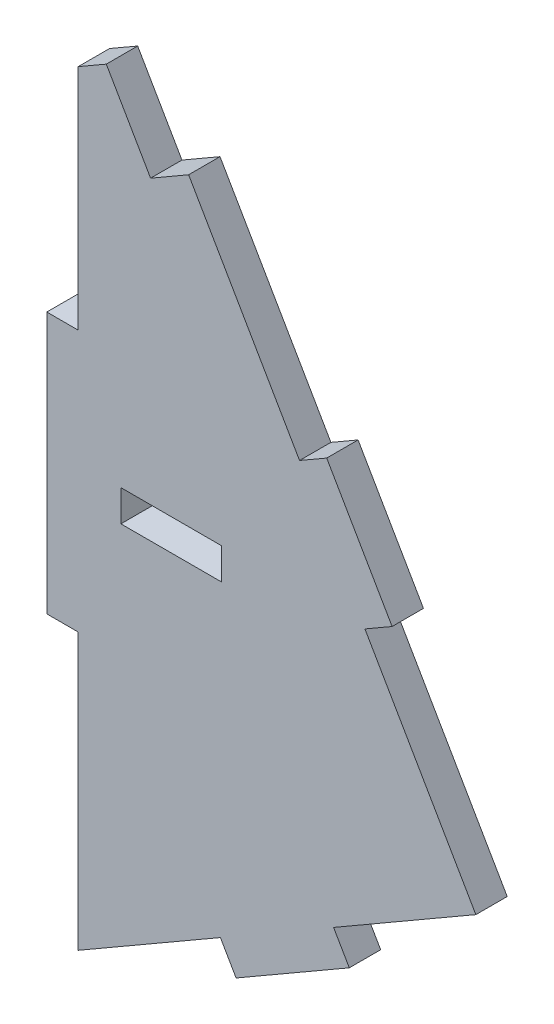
ISO-10303-21;
HEADER;
FILE_DESCRIPTION(('STEP AP214'),'2;1');
FILE_NAME('part.step','',(''),(''),'','','');
FILE_SCHEMA(('AUTOMOTIVE_DESIGN { 1 0 10303 214 1 1 1 1 }'));
ENDSEC;
DATA;
#1=APPLICATION_CONTEXT('core data for automotive mechanical design processes');
#2=APPLICATION_PROTOCOL_DEFINITION('international standard','automotive_design',2000,#1);
#3=PRODUCT_CONTEXT('',#1,'mechanical');
#4=PRODUCT('Part','Part','',(#3));
#5=PRODUCT_RELATED_PRODUCT_CATEGORY('part','',(#4));
#6=PRODUCT_DEFINITION_FORMATION('','',#4);
#7=PRODUCT_DEFINITION_CONTEXT('part definition',#1,'design');
#8=PRODUCT_DEFINITION('design','',#6,#7);
#9=PRODUCT_DEFINITION_SHAPE('','',#8);
#10=(LENGTH_UNIT() NAMED_UNIT(*) SI_UNIT(.MILLI.,.METRE.));
#11=(NAMED_UNIT(*) PLANE_ANGLE_UNIT() SI_UNIT($,.RADIAN.));
#12=(NAMED_UNIT(*) SI_UNIT($,.STERADIAN.) SOLID_ANGLE_UNIT());
#13=UNCERTAINTY_MEASURE_WITH_UNIT(LENGTH_MEASURE(1.E-05),#10,'distance_accuracy_value','');
#14=(GEOMETRIC_REPRESENTATION_CONTEXT(3) GLOBAL_UNCERTAINTY_ASSIGNED_CONTEXT((#13)) GLOBAL_UNIT_ASSIGNED_CONTEXT((#10,
#11,#12)) REPRESENTATION_CONTEXT('',''));
#15=CARTESIAN_POINT('',(0.,0.,0.));
#16=DIRECTION('',(0.,0.,1.));
#17=DIRECTION('',(1.,0.,0.));
#18=AXIS2_PLACEMENT_3D('',#15,#16,#17);
#19=CARTESIAN_POINT('',(0.,0.,1.524));
#20=DIRECTION('',(0.,0.,1.));
#21=DIRECTION('',(1.,0.,0.));
#22=AXIS2_PLACEMENT_3D('',#19,#20,#21);
#23=PLANE('',#22);
#24=DIRECTION('',(0.,-1.,0.));
#25=VECTOR('',#24,1.);
#26=CARTESIAN_POINT('',(1.524,-21.2606271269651,1.524));
#27=LINE('',#26,#25);
#28=CARTESIAN_POINT('',(1.524,-7.86895151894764,1.524));
#29=VERTEX_POINT('',#28);
#30=CARTESIAN_POINT('',(1.524,-21.2606271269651,1.524));
#31=VERTEX_POINT('',#30);
#32=EDGE_CURVE('E221',#29,#31,#27,.T.);
#33=ORIENTED_EDGE('',*,*,#32,.T.);
#34=DIRECTION('',(0.865892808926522,0.50022959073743,0.));
#35=VECTOR('',#34,1.);
#36=CARTESIAN_POINT('',(8.43381798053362,-17.268798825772,1.524));
#37=LINE('',#36,#35);
#38=CARTESIAN_POINT('',(8.43381798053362,-17.268798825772,1.524));
#39=VERTEX_POINT('',#38);
#40=EDGE_CURVE('E224',#31,#39,#37,.T.);
#41=ORIENTED_EDGE('',*,*,#40,.T.);
#42=DIRECTION('',(0.500229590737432,-0.865892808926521,0.));
#43=VECTOR('',#42,1.);
#44=CARTESIAN_POINT('',(8.43381798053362,-17.268798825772,1.524));
#45=LINE('',#44,#43);
#46=CARTESIAN_POINT('',(9.19616787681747,-18.588419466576,1.524));
#47=VERTEX_POINT('',#46);
#48=EDGE_CURVE('E227',#39,#47,#45,.T.);
#49=ORIENTED_EDGE('',*,*,#48,.T.);
#50=DIRECTION('',(0.865892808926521,0.500229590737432,0.));
#51=VECTOR('',#50,1.);
#52=CARTESIAN_POINT('',(9.19616787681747,-18.588419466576,1.524));
#53=LINE('',#52,#51);
#54=CARTESIAN_POINT('',(14.6945872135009,-15.4119615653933,1.524));
#55=VERTEX_POINT('',#54);
#56=EDGE_CURVE('E229',#47,#55,#53,.T.);
#57=ORIENTED_EDGE('',*,*,#56,.T.);
#58=DIRECTION('',(-0.500229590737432,0.865892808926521,0.));
#59=VECTOR('',#58,1.);
#60=CARTESIAN_POINT('',(13.932237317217,-14.0923409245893,1.524));
#61=LINE('',#60,#59);
#62=CARTESIAN_POINT('',(13.932237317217,-14.0923409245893,1.524));
#63=VERTEX_POINT('',#62);
#64=EDGE_CURVE('E231',#55,#63,#61,.T.);
#65=ORIENTED_EDGE('',*,*,#64,.T.);
#66=DIRECTION('',(0.865892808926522,0.500229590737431,0.));
#67=VECTOR('',#66,1.);
#68=CARTESIAN_POINT('',(20.8420552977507,-10.1005126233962,1.524));
#69=LINE('',#68,#67);
#70=CARTESIAN_POINT('',(20.8420552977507,-10.1005126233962,1.524));
#71=VERTEX_POINT('',#70);
#72=EDGE_CURVE('E233',#63,#71,#69,.T.);
#73=ORIENTED_EDGE('',*,*,#72,.T.);
#74=DIRECTION('',(-0.500229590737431,0.865892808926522,0.));
#75=VECTOR('',#74,1.);
#76=CARTESIAN_POINT('',(15.4543358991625,-0.774420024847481,1.524));
#77=LINE('',#76,#75);
#78=CARTESIAN_POINT('',(15.4543358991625,-0.774420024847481,1.524));
#79=VERTEX_POINT('',#78);
#80=EDGE_CURVE('E235',#71,#79,#77,.T.);
#81=ORIENTED_EDGE('',*,*,#80,.T.);
#82=DIRECTION('',(0.865892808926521,0.500229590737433,0.));
#83=VECTOR('',#82,1.);
#84=CARTESIAN_POINT('',(15.4543358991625,-0.774420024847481,1.524));
#85=LINE('',#84,#83);
#86=CARTESIAN_POINT('',(16.7739565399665,-0.0120701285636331,1.524));
#87=VERTEX_POINT('',#86);
#88=EDGE_CURVE('E237',#79,#87,#85,.T.);
#89=ORIENTED_EDGE('',*,*,#88,.T.);
#90=DIRECTION('',(-0.500229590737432,0.865892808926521,0.));
#91=VECTOR('',#90,1.);
#92=CARTESIAN_POINT('',(16.7739565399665,-0.0120701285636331,1.524));
#93=LINE('',#92,#91);
#94=CARTESIAN_POINT('',(13.5974986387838,5.48634920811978,1.524));
#95=VERTEX_POINT('',#94);
#96=EDGE_CURVE('E239',#87,#95,#93,.T.);
#97=ORIENTED_EDGE('',*,*,#96,.T.);
#98=DIRECTION('',(-0.865892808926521,-0.500229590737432,0.));
#99=VECTOR('',#98,1.);
#100=CARTESIAN_POINT('',(12.2778779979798,4.72399931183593,1.524));
#101=LINE('',#100,#99);
#102=CARTESIAN_POINT('',(12.2778779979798,4.72399931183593,1.524));
#103=VERTEX_POINT('',#102);
#104=EDGE_CURVE('E241',#95,#103,#101,.T.);
#105=ORIENTED_EDGE('',*,*,#104,.T.);
#106=DIRECTION('',(-0.500229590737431,0.865892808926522,0.));
#107=VECTOR('',#106,1.);
#108=CARTESIAN_POINT('',(6.89015859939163,14.0500919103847,1.524));
#109=LINE('',#108,#107);
#110=CARTESIAN_POINT('',(6.89015859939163,14.0500919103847,1.524));
#111=VERTEX_POINT('',#110);
#112=EDGE_CURVE('E243',#103,#111,#109,.T.);
#113=ORIENTED_EDGE('',*,*,#112,.T.);
#114=DIRECTION('',(-0.865892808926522,-0.500229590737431,0.));
#115=VECTOR('',#114,1.);
#116=CARTESIAN_POINT('',(5.04168218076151,12.9822200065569,1.524));
#117=LINE('',#116,#115);
#118=CARTESIAN_POINT('',(5.04168218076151,12.9822200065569,1.524));
#119=VERTEX_POINT('',#118);
#120=EDGE_CURVE('E245',#111,#119,#117,.T.);
#121=ORIENTED_EDGE('',*,*,#120,.T.);
#122=DIRECTION('',(-0.500229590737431,0.865892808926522,0.));
#123=VECTOR('',#122,1.);
#124=CARTESIAN_POINT('',(2.8908091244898,16.7053614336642,1.524));
#125=LINE('',#124,#123);
#126=CARTESIAN_POINT('',(2.8908091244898,16.7053614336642,1.524));
#127=VERTEX_POINT('',#126);
#128=EDGE_CURVE('E247',#119,#127,#125,.T.);
#129=ORIENTED_EDGE('',*,*,#128,.T.);
#130=DIRECTION('',(-0.865892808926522,-0.500229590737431,0.));
#131=VECTOR('',#130,1.);
#132=CARTESIAN_POINT('',(1.524,15.9157505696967,1.524));
#133=LINE('',#132,#131);
#134=CARTESIAN_POINT('',(1.524,15.9157505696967,1.524));
#135=VERTEX_POINT('',#134);
#136=EDGE_CURVE('E249',#127,#135,#133,.T.);
#137=ORIENTED_EDGE('',*,*,#136,.T.);
#138=DIRECTION('',(0.,-1.,0.));
#139=VECTOR('',#138,1.);
#140=CARTESIAN_POINT('',(1.524,4.83104848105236,1.524));
#141=LINE('',#140,#139);
#142=CARTESIAN_POINT('',(1.524,4.83104848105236,1.524));
#143=VERTEX_POINT('',#142);
#144=EDGE_CURVE('E251',#135,#143,#141,.T.);
#145=ORIENTED_EDGE('',*,*,#144,.T.);
#146=DIRECTION('',(-1.,0.,0.));
#147=VECTOR('',#146,1.);
#148=CARTESIAN_POINT('',(0.,4.83104848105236,1.524));
#149=LINE('',#148,#147);
#150=CARTESIAN_POINT('',(0.,4.83104848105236,1.524));
#151=VERTEX_POINT('',#150);
#152=EDGE_CURVE('E253',#143,#151,#149,.T.);
#153=ORIENTED_EDGE('',*,*,#152,.T.);
#154=DIRECTION('',(0.,-1.,0.));
#155=VECTOR('',#154,1.);
#156=CARTESIAN_POINT('',(0.,-7.86895151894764,1.524));
#157=LINE('',#156,#155);
#158=CARTESIAN_POINT('',(0.,-7.86895151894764,1.524));
#159=VERTEX_POINT('',#158);
#160=EDGE_CURVE('E255',#151,#159,#157,.T.);
#161=ORIENTED_EDGE('',*,*,#160,.T.);
#162=DIRECTION('',(1.,0.,0.));
#163=VECTOR('',#162,1.);
#164=CARTESIAN_POINT('',(1.524,-7.86895151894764,1.524));
#165=LINE('',#164,#163);
#166=EDGE_CURVE('E257',#159,#29,#165,.T.);
#167=ORIENTED_EDGE('',*,*,#166,.T.);
#168=EDGE_LOOP('',(#33,#41,#49,#57,#65,#73,#81,#89,#97,#105,#113,#121,#129,#137,#145,#153,#161,#167));
#169=FACE_BOUND('',#168,.T.);
#170=DIRECTION('',(1.,0.,0.));
#171=VECTOR('',#170,1.);
#172=CARTESIAN_POINT('',(3.59954891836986,-2.28095151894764,1.524));
#173=LINE('',#172,#171);
#174=CARTESIAN_POINT('',(3.59954891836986,-2.28095151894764,1.524));
#175=VERTEX_POINT('',#174);
#176=CARTESIAN_POINT('',(8.49527832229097,-2.28095151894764,1.524));
#177=VERTEX_POINT('',#176);
#178=EDGE_CURVE('E193',#175,#177,#173,.T.);
#179=ORIENTED_EDGE('',*,*,#178,.F.);
#180=DIRECTION('',(0.,-1.,0.));
#181=VECTOR('',#180,1.);
#182=CARTESIAN_POINT('',(3.59954891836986,-2.28095151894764,1.524));
#183=LINE('',#182,#181);
#184=CARTESIAN_POINT('',(3.59954891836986,-0.756951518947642,1.524));
#185=VERTEX_POINT('',#184);
#186=EDGE_CURVE('E185',#185,#175,#183,.T.);
#187=ORIENTED_EDGE('',*,*,#186,.F.);
#188=DIRECTION('',(-1.,0.,0.));
#189=VECTOR('',#188,1.);
#190=CARTESIAN_POINT('',(3.59954891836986,-0.756951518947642,1.524));
#191=LINE('',#190,#189);
#192=CARTESIAN_POINT('',(8.49527832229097,-0.756951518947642,1.524));
#193=VERTEX_POINT('',#192);
#194=EDGE_CURVE('E207',#193,#185,#191,.T.);
#195=ORIENTED_EDGE('',*,*,#194,.F.);
#196=DIRECTION('',(0.,1.,0.));
#197=VECTOR('',#196,1.);
#198=CARTESIAN_POINT('',(8.49527832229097,-2.28095151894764,1.524));
#199=LINE('',#198,#197);
#200=EDGE_CURVE('E205',#177,#193,#199,.T.);
#201=ORIENTED_EDGE('',*,*,#200,.F.);
#202=EDGE_LOOP('',(#179,#187,#195,#201));
#203=FACE_BOUND('',#202,.T.);
#204=ADVANCED_FACE('F36',(#169,#203),#23,.T.);
#205=CARTESIAN_POINT('',(0.,0.,0.));
#206=DIRECTION('',(0.,0.,1.));
#207=DIRECTION('',(1.,0.,0.));
#208=AXIS2_PLACEMENT_3D('',#205,#206,#207);
#209=PLANE('',#208);
#210=DIRECTION('',(0.,-1.,0.));
#211=VECTOR('',#210,1.);
#212=CARTESIAN_POINT('',(1.524,-21.2606271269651,0.));
#213=LINE('',#212,#211);
#214=CARTESIAN_POINT('',(1.524,-7.86895151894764,0.));
#215=VERTEX_POINT('',#214);
#216=CARTESIAN_POINT('',(1.524,-21.2606271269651,0.));
#217=VERTEX_POINT('',#216);
#218=EDGE_CURVE('E201',#215,#217,#213,.T.);
#219=ORIENTED_EDGE('',*,*,#218,.F.);
#220=DIRECTION('',(1.,0.,0.));
#221=VECTOR('',#220,1.);
#222=CARTESIAN_POINT('',(1.524,-7.86895151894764,0.));
#223=LINE('',#222,#221);
#224=CARTESIAN_POINT('',(0.,-7.86895151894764,0.));
#225=VERTEX_POINT('',#224);
#226=EDGE_CURVE('E225',#225,#215,#223,.T.);
#227=ORIENTED_EDGE('',*,*,#226,.F.);
#228=DIRECTION('',(0.,-1.,0.));
#229=VECTOR('',#228,1.);
#230=CARTESIAN_POINT('',(0.,-7.86895151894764,0.));
#231=LINE('',#230,#229);
#232=CARTESIAN_POINT('',(0.,4.83104848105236,0.));
#233=VERTEX_POINT('',#232);
#234=EDGE_CURVE('E292',#233,#225,#231,.T.);
#235=ORIENTED_EDGE('',*,*,#234,.F.);
#236=DIRECTION('',(-1.,0.,0.));
#237=VECTOR('',#236,1.);
#238=CARTESIAN_POINT('',(0.,4.83104848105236,0.));
#239=LINE('',#238,#237);
#240=CARTESIAN_POINT('',(1.524,4.83104848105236,0.));
#241=VERTEX_POINT('',#240);
#242=EDGE_CURVE('E290',#241,#233,#239,.T.);
#243=ORIENTED_EDGE('',*,*,#242,.F.);
#244=DIRECTION('',(0.,-1.,0.));
#245=VECTOR('',#244,1.);
#246=CARTESIAN_POINT('',(1.524,4.83104848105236,0.));
#247=LINE('',#246,#245);
#248=CARTESIAN_POINT('',(1.524,15.9157505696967,0.));
#249=VERTEX_POINT('',#248);
#250=EDGE_CURVE('E288',#249,#241,#247,.T.);
#251=ORIENTED_EDGE('',*,*,#250,.F.);
#252=DIRECTION('',(-0.865892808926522,-0.500229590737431,0.));
#253=VECTOR('',#252,1.);
#254=CARTESIAN_POINT('',(1.524,15.9157505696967,0.));
#255=LINE('',#254,#253);
#256=CARTESIAN_POINT('',(2.8908091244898,16.7053614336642,0.));
#257=VERTEX_POINT('',#256);
#258=EDGE_CURVE('E286',#257,#249,#255,.T.);
#259=ORIENTED_EDGE('',*,*,#258,.F.);
#260=DIRECTION('',(-0.500229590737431,0.865892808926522,0.));
#261=VECTOR('',#260,1.);
#262=CARTESIAN_POINT('',(2.8908091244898,16.7053614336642,0.));
#263=LINE('',#262,#261);
#264=CARTESIAN_POINT('',(5.04168218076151,12.9822200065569,0.));
#265=VERTEX_POINT('',#264);
#266=EDGE_CURVE('E284',#265,#257,#263,.T.);
#267=ORIENTED_EDGE('',*,*,#266,.F.);
#268=DIRECTION('',(-0.865892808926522,-0.500229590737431,0.));
#269=VECTOR('',#268,1.);
#270=CARTESIAN_POINT('',(5.04168218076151,12.9822200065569,0.));
#271=LINE('',#270,#269);
#272=CARTESIAN_POINT('',(6.89015859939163,14.0500919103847,0.));
#273=VERTEX_POINT('',#272);
#274=EDGE_CURVE('E282',#273,#265,#271,.T.);
#275=ORIENTED_EDGE('',*,*,#274,.F.);
#276=DIRECTION('',(-0.500229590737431,0.865892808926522,0.));
#277=VECTOR('',#276,1.);
#278=CARTESIAN_POINT('',(6.89015859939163,14.0500919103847,0.));
#279=LINE('',#278,#277);
#280=CARTESIAN_POINT('',(12.2778779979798,4.72399931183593,0.));
#281=VERTEX_POINT('',#280);
#282=EDGE_CURVE('E280',#281,#273,#279,.T.);
#283=ORIENTED_EDGE('',*,*,#282,.F.);
#284=DIRECTION('',(-0.865892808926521,-0.500229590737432,0.));
#285=VECTOR('',#284,1.);
#286=CARTESIAN_POINT('',(12.2778779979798,4.72399931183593,0.));
#287=LINE('',#286,#285);
#288=CARTESIAN_POINT('',(13.5974986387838,5.48634920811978,0.));
#289=VERTEX_POINT('',#288);
#290=EDGE_CURVE('E278',#289,#281,#287,.T.);
#291=ORIENTED_EDGE('',*,*,#290,.F.);
#292=DIRECTION('',(-0.500229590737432,0.865892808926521,0.));
#293=VECTOR('',#292,1.);
#294=CARTESIAN_POINT('',(16.7739565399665,-0.0120701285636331,0.));
#295=LINE('',#294,#293);
#296=CARTESIAN_POINT('',(16.7739565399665,-0.0120701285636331,0.));
#297=VERTEX_POINT('',#296);
#298=EDGE_CURVE('E276',#297,#289,#295,.T.);
#299=ORIENTED_EDGE('',*,*,#298,.F.);
#300=DIRECTION('',(0.865892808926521,0.500229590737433,0.));
#301=VECTOR('',#300,1.);
#302=CARTESIAN_POINT('',(15.4543358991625,-0.774420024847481,0.));
#303=LINE('',#302,#301);
#304=CARTESIAN_POINT('',(15.4543358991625,-0.774420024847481,0.));
#305=VERTEX_POINT('',#304);
#306=EDGE_CURVE('E274',#305,#297,#303,.T.);
#307=ORIENTED_EDGE('',*,*,#306,.F.);
#308=DIRECTION('',(-0.500229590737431,0.865892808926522,0.));
#309=VECTOR('',#308,1.);
#310=CARTESIAN_POINT('',(15.4543358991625,-0.774420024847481,0.));
#311=LINE('',#310,#309);
#312=CARTESIAN_POINT('',(20.8420552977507,-10.1005126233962,0.));
#313=VERTEX_POINT('',#312);
#314=EDGE_CURVE('E272',#313,#305,#311,.T.);
#315=ORIENTED_EDGE('',*,*,#314,.F.);
#316=DIRECTION('',(0.865892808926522,0.500229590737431,0.));
#317=VECTOR('',#316,1.);
#318=CARTESIAN_POINT('',(20.8420552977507,-10.1005126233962,0.));
#319=LINE('',#318,#317);
#320=CARTESIAN_POINT('',(13.932237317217,-14.0923409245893,0.));
#321=VERTEX_POINT('',#320);
#322=EDGE_CURVE('E270',#321,#313,#319,.T.);
#323=ORIENTED_EDGE('',*,*,#322,.F.);
#324=DIRECTION('',(-0.500229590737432,0.865892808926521,0.));
#325=VECTOR('',#324,1.);
#326=CARTESIAN_POINT('',(13.932237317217,-14.0923409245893,0.));
#327=LINE('',#326,#325);
#328=CARTESIAN_POINT('',(14.6945872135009,-15.4119615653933,0.));
#329=VERTEX_POINT('',#328);
#330=EDGE_CURVE('E268',#329,#321,#327,.T.);
#331=ORIENTED_EDGE('',*,*,#330,.F.);
#332=DIRECTION('',(0.865892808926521,0.500229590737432,0.));
#333=VECTOR('',#332,1.);
#334=CARTESIAN_POINT('',(9.19616787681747,-18.588419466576,0.));
#335=LINE('',#334,#333);
#336=CARTESIAN_POINT('',(9.19616787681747,-18.588419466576,0.));
#337=VERTEX_POINT('',#336);
#338=EDGE_CURVE('E266',#337,#329,#335,.T.);
#339=ORIENTED_EDGE('',*,*,#338,.F.);
#340=DIRECTION('',(0.500229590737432,-0.865892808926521,0.));
#341=VECTOR('',#340,1.);
#342=CARTESIAN_POINT('',(8.43381798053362,-17.268798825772,0.));
#343=LINE('',#342,#341);
#344=CARTESIAN_POINT('',(8.43381798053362,-17.268798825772,0.));
#345=VERTEX_POINT('',#344);
#346=EDGE_CURVE('E264',#345,#337,#343,.T.);
#347=ORIENTED_EDGE('',*,*,#346,.F.);
#348=DIRECTION('',(0.865892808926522,0.50022959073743,0.));
#349=VECTOR('',#348,1.);
#350=CARTESIAN_POINT('',(8.43381798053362,-17.268798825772,0.));
#351=LINE('',#350,#349);
#352=EDGE_CURVE('E262',#217,#345,#351,.T.);
#353=ORIENTED_EDGE('',*,*,#352,.F.);
#354=EDGE_LOOP('',(#219,#227,#235,#243,#251,#259,#267,#275,#283,#291,#299,#307,#315,#323,#331,
#339,#347,#353));
#355=FACE_BOUND('',#354,.T.);
#356=DIRECTION('',(0.,-1.,0.));
#357=VECTOR('',#356,1.);
#358=CARTESIAN_POINT('',(3.59954891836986,-2.28095151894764,0.));
#359=LINE('',#358,#357);
#360=CARTESIAN_POINT('',(3.59954891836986,-0.756951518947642,0.));
#361=VERTEX_POINT('',#360);
#362=CARTESIAN_POINT('',(3.59954891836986,-2.28095151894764,0.));
#363=VERTEX_POINT('',#362);
#364=EDGE_CURVE('E59',#361,#363,#359,.T.);
#365=ORIENTED_EDGE('',*,*,#364,.T.);
#366=DIRECTION('',(1.,0.,0.));
#367=VECTOR('',#366,1.);
#368=CARTESIAN_POINT('',(3.59954891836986,-2.28095151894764,0.));
#369=LINE('',#368,#367);
#370=CARTESIAN_POINT('',(8.49527832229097,-2.28095151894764,0.));
#371=VERTEX_POINT('',#370);
#372=EDGE_CURVE('E200',#363,#371,#369,.T.);
#373=ORIENTED_EDGE('',*,*,#372,.T.);
#374=DIRECTION('',(0.,1.,0.));
#375=VECTOR('',#374,1.);
#376=CARTESIAN_POINT('',(8.49527832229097,-2.28095151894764,0.));
#377=LINE('',#376,#375);
#378=CARTESIAN_POINT('',(8.49527832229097,-0.756951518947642,0.));
#379=VERTEX_POINT('',#378);
#380=EDGE_CURVE('E213',#371,#379,#377,.T.);
#381=ORIENTED_EDGE('',*,*,#380,.T.);
#382=DIRECTION('',(-1.,0.,0.));
#383=VECTOR('',#382,1.);
#384=CARTESIAN_POINT('',(3.59954891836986,-0.756951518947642,0.));
#385=LINE('',#384,#383);
#386=EDGE_CURVE('E194',#379,#361,#385,.T.);
#387=ORIENTED_EDGE('',*,*,#386,.T.);
#388=EDGE_LOOP('',(#365,#373,#381,#387));
#389=FACE_BOUND('',#388,.T.);
#390=ADVANCED_FACE('F352',(#355,#389),#209,.F.);
#391=CARTESIAN_POINT('',(1.524,-21.2606271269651,1.524));
#392=DIRECTION('',(1.,0.,0.));
#393=DIRECTION('',(0.,0.,-1.));
#394=AXIS2_PLACEMENT_3D('',#391,#392,#393);
#395=PLANE('',#394);
#396=ORIENTED_EDGE('',*,*,#218,.T.);
#397=DIRECTION('',(0.,0.,-1.));
#398=VECTOR('',#397,1.);
#399=CARTESIAN_POINT('',(1.524,-21.2606271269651,1.524));
#400=LINE('',#399,#398);
#401=EDGE_CURVE('E11',#31,#217,#400,.T.);
#402=ORIENTED_EDGE('',*,*,#401,.F.);
#403=ORIENTED_EDGE('',*,*,#32,.F.);
#404=DIRECTION('',(0.,0.,-1.));
#405=VECTOR('',#404,1.);
#406=CARTESIAN_POINT('',(1.524,-7.86895151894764,1.524));
#407=LINE('',#406,#405);
#408=EDGE_CURVE('E259',#29,#215,#407,.T.);
#409=ORIENTED_EDGE('',*,*,#408,.T.);
#410=EDGE_LOOP('',(#396,#402,#403,#409));
#411=FACE_BOUND('',#410,.T.);
#412=ADVANCED_FACE('F38',(#411),#395,.F.);
#413=CARTESIAN_POINT('',(8.43381798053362,-17.268798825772,1.524));
#414=DIRECTION('',(-0.50022959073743,0.865892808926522,0.));
#415=DIRECTION('',(-0.865892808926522,-0.50022959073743,0.));
#416=AXIS2_PLACEMENT_3D('',#413,#414,#415);
#417=PLANE('',#416);
#418=ORIENTED_EDGE('',*,*,#352,.T.);
#419=DIRECTION('',(0.,0.,-1.));
#420=VECTOR('',#419,1.);
#421=CARTESIAN_POINT('',(8.43381798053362,-17.268798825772,1.524));
#422=LINE('',#421,#420);
#423=EDGE_CURVE('E44',#39,#345,#422,.T.);
#424=ORIENTED_EDGE('',*,*,#423,.F.);
#425=ORIENTED_EDGE('',*,*,#40,.F.);
#426=ORIENTED_EDGE('',*,*,#401,.T.);
#427=EDGE_LOOP('',(#418,#424,#425,#426));
#428=FACE_BOUND('',#427,.T.);
#429=ADVANCED_FACE('F369',(#428),#417,.F.);
#430=CARTESIAN_POINT('',(8.43381798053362,-17.268798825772,1.524));
#431=DIRECTION('',(0.865892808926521,0.500229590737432,0.));
#432=DIRECTION('',(-0.500229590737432,0.865892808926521,0.));
#433=AXIS2_PLACEMENT_3D('',#430,#431,#432);
#434=PLANE('',#433);
#435=ORIENTED_EDGE('',*,*,#346,.T.);
#436=DIRECTION('',(0.,0.,-1.));
#437=VECTOR('',#436,1.);
#438=CARTESIAN_POINT('',(9.19616787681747,-18.588419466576,1.524));
#439=LINE('',#438,#437);
#440=EDGE_CURVE('E339',#47,#337,#439,.T.);
#441=ORIENTED_EDGE('',*,*,#440,.F.);
#442=ORIENTED_EDGE('',*,*,#48,.F.);
#443=ORIENTED_EDGE('',*,*,#423,.T.);
#444=EDGE_LOOP('',(#435,#441,#442,#443));
#445=FACE_BOUND('',#444,.T.);
#446=ADVANCED_FACE('F346',(#445),#434,.F.);
#447=CARTESIAN_POINT('',(9.19616787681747,-18.588419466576,1.524));
#448=DIRECTION('',(-0.500229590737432,0.865892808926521,0.));
#449=DIRECTION('',(-0.865892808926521,-0.500229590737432,0.));
#450=AXIS2_PLACEMENT_3D('',#447,#448,#449);
#451=PLANE('',#450);
#452=ORIENTED_EDGE('',*,*,#338,.T.);
#453=DIRECTION('',(0.,0.,-1.));
#454=VECTOR('',#453,1.);
#455=CARTESIAN_POINT('',(14.6945872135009,-15.4119615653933,1.524));
#456=LINE('',#455,#454);
#457=EDGE_CURVE('E336',#55,#329,#456,.T.);
#458=ORIENTED_EDGE('',*,*,#457,.F.);
#459=ORIENTED_EDGE('',*,*,#56,.F.);
#460=ORIENTED_EDGE('',*,*,#440,.T.);
#461=EDGE_LOOP('',(#452,#458,#459,#460));
#462=FACE_BOUND('',#461,.T.);
#463=ADVANCED_FACE('F358',(#462),#451,.F.);
#464=CARTESIAN_POINT('',(13.932237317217,-14.0923409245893,1.524));
#465=DIRECTION('',(-0.865892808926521,-0.500229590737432,0.));
#466=DIRECTION('',(0.500229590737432,-0.865892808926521,0.));
#467=AXIS2_PLACEMENT_3D('',#464,#465,#466);
#468=PLANE('',#467);
#469=ORIENTED_EDGE('',*,*,#330,.T.);
#470=DIRECTION('',(0.,0.,-1.));
#471=VECTOR('',#470,1.);
#472=CARTESIAN_POINT('',(13.932237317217,-14.0923409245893,1.524));
#473=LINE('',#472,#471);
#474=EDGE_CURVE('E333',#63,#321,#473,.T.);
#475=ORIENTED_EDGE('',*,*,#474,.F.);
#476=ORIENTED_EDGE('',*,*,#64,.F.);
#477=ORIENTED_EDGE('',*,*,#457,.T.);
#478=EDGE_LOOP('',(#469,#475,#476,#477));
#479=FACE_BOUND('',#478,.T.);
#480=ADVANCED_FACE('F362',(#479),#468,.F.);
#481=CARTESIAN_POINT('',(20.8420552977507,-10.1005126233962,1.524));
#482=DIRECTION('',(-0.500229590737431,0.865892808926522,0.));
#483=DIRECTION('',(-0.865892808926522,-0.500229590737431,0.));
#484=AXIS2_PLACEMENT_3D('',#481,#482,#483);
#485=PLANE('',#484);
#486=ORIENTED_EDGE('',*,*,#322,.T.);
#487=DIRECTION('',(0.,0.,-1.));
#488=VECTOR('',#487,1.);
#489=CARTESIAN_POINT('',(20.8420552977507,-10.1005126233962,1.524));
#490=LINE('',#489,#488);
#491=EDGE_CURVE('E330',#71,#313,#490,.T.);
#492=ORIENTED_EDGE('',*,*,#491,.F.);
#493=ORIENTED_EDGE('',*,*,#72,.F.);
#494=ORIENTED_EDGE('',*,*,#474,.T.);
#495=EDGE_LOOP('',(#486,#492,#493,#494));
#496=FACE_BOUND('',#495,.T.);
#497=ADVANCED_FACE('F432',(#496),#485,.F.);
#498=CARTESIAN_POINT('',(15.4543358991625,-0.774420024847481,1.524));
#499=DIRECTION('',(-0.865892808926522,-0.500229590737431,0.));
#500=DIRECTION('',(0.500229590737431,-0.865892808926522,0.));
#501=AXIS2_PLACEMENT_3D('',#498,#499,#500);
#502=PLANE('',#501);
#503=ORIENTED_EDGE('',*,*,#314,.T.);
#504=DIRECTION('',(0.,0.,-1.));
#505=VECTOR('',#504,1.);
#506=CARTESIAN_POINT('',(15.4543358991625,-0.774420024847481,1.524));
#507=LINE('',#506,#505);
#508=EDGE_CURVE('E327',#79,#305,#507,.T.);
#509=ORIENTED_EDGE('',*,*,#508,.F.);
#510=ORIENTED_EDGE('',*,*,#80,.F.);
#511=ORIENTED_EDGE('',*,*,#491,.T.);
#512=EDGE_LOOP('',(#503,#509,#510,#511));
#513=FACE_BOUND('',#512,.T.);
#514=ADVANCED_FACE('F430',(#513),#502,.F.);
#515=CARTESIAN_POINT('',(15.4543358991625,-0.774420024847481,1.524));
#516=DIRECTION('',(-0.500229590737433,0.865892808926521,0.));
#517=DIRECTION('',(-0.865892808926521,-0.500229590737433,0.));
#518=AXIS2_PLACEMENT_3D('',#515,#516,#517);
#519=PLANE('',#518);
#520=ORIENTED_EDGE('',*,*,#306,.T.);
#521=DIRECTION('',(0.,0.,-1.));
#522=VECTOR('',#521,1.);
#523=CARTESIAN_POINT('',(16.7739565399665,-0.0120701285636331,1.524));
#524=LINE('',#523,#522);
#525=EDGE_CURVE('E324',#87,#297,#524,.T.);
#526=ORIENTED_EDGE('',*,*,#525,.F.);
#527=ORIENTED_EDGE('',*,*,#88,.F.);
#528=ORIENTED_EDGE('',*,*,#508,.T.);
#529=EDGE_LOOP('',(#520,#526,#527,#528));
#530=FACE_BOUND('',#529,.T.);
#531=ADVANCED_FACE('F426',(#530),#519,.F.);
#532=CARTESIAN_POINT('',(16.7739565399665,-0.0120701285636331,1.524));
#533=DIRECTION('',(-0.865892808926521,-0.500229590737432,0.));
#534=DIRECTION('',(0.500229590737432,-0.865892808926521,0.));
#535=AXIS2_PLACEMENT_3D('',#532,#533,#534);
#536=PLANE('',#535);
#537=ORIENTED_EDGE('',*,*,#298,.T.);
#538=DIRECTION('',(0.,0.,-1.));
#539=VECTOR('',#538,1.);
#540=CARTESIAN_POINT('',(13.5974986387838,5.48634920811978,1.524));
#541=LINE('',#540,#539);
#542=EDGE_CURVE('E321',#95,#289,#541,.T.);
#543=ORIENTED_EDGE('',*,*,#542,.F.);
#544=ORIENTED_EDGE('',*,*,#96,.F.);
#545=ORIENTED_EDGE('',*,*,#525,.T.);
#546=EDGE_LOOP('',(#537,#543,#544,#545));
#547=FACE_BOUND('',#546,.T.);
#548=ADVANCED_FACE('F421',(#547),#536,.F.);
#549=CARTESIAN_POINT('',(12.2778779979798,4.72399931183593,1.524));
#550=DIRECTION('',(0.500229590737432,-0.865892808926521,0.));
#551=DIRECTION('',(0.865892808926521,0.500229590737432,0.));
#552=AXIS2_PLACEMENT_3D('',#549,#550,#551);
#553=PLANE('',#552);
#554=ORIENTED_EDGE('',*,*,#290,.T.);
#555=DIRECTION('',(0.,0.,-1.));
#556=VECTOR('',#555,1.);
#557=CARTESIAN_POINT('',(12.2778779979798,4.72399931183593,1.524));
#558=LINE('',#557,#556);
#559=EDGE_CURVE('E318',#103,#281,#558,.T.);
#560=ORIENTED_EDGE('',*,*,#559,.F.);
#561=ORIENTED_EDGE('',*,*,#104,.F.);
#562=ORIENTED_EDGE('',*,*,#542,.T.);
#563=EDGE_LOOP('',(#554,#560,#561,#562));
#564=FACE_BOUND('',#563,.T.);
#565=ADVANCED_FACE('F415',(#564),#553,.F.);
#566=CARTESIAN_POINT('',(6.89015859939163,14.0500919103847,1.524));
#567=DIRECTION('',(-0.865892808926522,-0.500229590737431,0.));
#568=DIRECTION('',(0.500229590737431,-0.865892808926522,0.));
#569=AXIS2_PLACEMENT_3D('',#566,#567,#568);
#570=PLANE('',#569);
#571=ORIENTED_EDGE('',*,*,#282,.T.);
#572=DIRECTION('',(0.,0.,-1.));
#573=VECTOR('',#572,1.);
#574=CARTESIAN_POINT('',(6.89015859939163,14.0500919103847,1.524));
#575=LINE('',#574,#573);
#576=EDGE_CURVE('E315',#111,#273,#575,.T.);
#577=ORIENTED_EDGE('',*,*,#576,.F.);
#578=ORIENTED_EDGE('',*,*,#112,.F.);
#579=ORIENTED_EDGE('',*,*,#559,.T.);
#580=EDGE_LOOP('',(#571,#577,#578,#579));
#581=FACE_BOUND('',#580,.T.);
#582=ADVANCED_FACE('F411',(#581),#570,.F.);
#583=CARTESIAN_POINT('',(5.04168218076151,12.9822200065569,1.524));
#584=DIRECTION('',(0.500229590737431,-0.865892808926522,0.));
#585=DIRECTION('',(0.865892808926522,0.500229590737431,0.));
#586=AXIS2_PLACEMENT_3D('',#583,#584,#585);
#587=PLANE('',#586);
#588=ORIENTED_EDGE('',*,*,#274,.T.);
#589=DIRECTION('',(0.,0.,-1.));
#590=VECTOR('',#589,1.);
#591=CARTESIAN_POINT('',(5.04168218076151,12.9822200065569,1.524));
#592=LINE('',#591,#590);
#593=EDGE_CURVE('E312',#119,#265,#592,.T.);
#594=ORIENTED_EDGE('',*,*,#593,.F.);
#595=ORIENTED_EDGE('',*,*,#120,.F.);
#596=ORIENTED_EDGE('',*,*,#576,.T.);
#597=EDGE_LOOP('',(#588,#594,#595,#596));
#598=FACE_BOUND('',#597,.T.);
#599=ADVANCED_FACE('F406',(#598),#587,.F.);
#600=CARTESIAN_POINT('',(2.8908091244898,16.7053614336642,1.524));
#601=DIRECTION('',(-0.865892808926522,-0.500229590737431,0.));
#602=DIRECTION('',(0.500229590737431,-0.865892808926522,0.));
#603=AXIS2_PLACEMENT_3D('',#600,#601,#602);
#604=PLANE('',#603);
#605=ORIENTED_EDGE('',*,*,#266,.T.);
#606=DIRECTION('',(0.,0.,-1.));
#607=VECTOR('',#606,1.);
#608=CARTESIAN_POINT('',(2.8908091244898,16.7053614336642,1.524));
#609=LINE('',#608,#607);
#610=EDGE_CURVE('E309',#127,#257,#609,.T.);
#611=ORIENTED_EDGE('',*,*,#610,.F.);
#612=ORIENTED_EDGE('',*,*,#128,.F.);
#613=ORIENTED_EDGE('',*,*,#593,.T.);
#614=EDGE_LOOP('',(#605,#611,#612,#613));
#615=FACE_BOUND('',#614,.T.);
#616=ADVANCED_FACE('F400',(#615),#604,.F.);
#617=CARTESIAN_POINT('',(1.524,15.9157505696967,1.524));
#618=DIRECTION('',(0.500229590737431,-0.865892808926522,0.));
#619=DIRECTION('',(0.865892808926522,0.500229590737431,0.));
#620=AXIS2_PLACEMENT_3D('',#617,#618,#619);
#621=PLANE('',#620);
#622=ORIENTED_EDGE('',*,*,#258,.T.);
#623=DIRECTION('',(0.,0.,-1.));
#624=VECTOR('',#623,1.);
#625=CARTESIAN_POINT('',(1.524,15.9157505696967,1.524));
#626=LINE('',#625,#624);
#627=EDGE_CURVE('E306',#135,#249,#626,.T.);
#628=ORIENTED_EDGE('',*,*,#627,.F.);
#629=ORIENTED_EDGE('',*,*,#136,.F.);
#630=ORIENTED_EDGE('',*,*,#610,.T.);
#631=EDGE_LOOP('',(#622,#628,#629,#630));
#632=FACE_BOUND('',#631,.T.);
#633=ADVANCED_FACE('F396',(#632),#621,.F.);
#634=CARTESIAN_POINT('',(1.524,4.83104848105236,1.524));
#635=DIRECTION('',(1.,0.,0.));
#636=DIRECTION('',(0.,0.,-1.));
#637=AXIS2_PLACEMENT_3D('',#634,#635,#636);
#638=PLANE('',#637);
#639=ORIENTED_EDGE('',*,*,#250,.T.);
#640=DIRECTION('',(0.,0.,-1.));
#641=VECTOR('',#640,1.);
#642=CARTESIAN_POINT('',(1.524,4.83104848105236,1.524));
#643=LINE('',#642,#641);
#644=EDGE_CURVE('E303',#143,#241,#643,.T.);
#645=ORIENTED_EDGE('',*,*,#644,.F.);
#646=ORIENTED_EDGE('',*,*,#144,.F.);
#647=ORIENTED_EDGE('',*,*,#627,.T.);
#648=EDGE_LOOP('',(#639,#645,#646,#647));
#649=FACE_BOUND('',#648,.T.);
#650=ADVANCED_FACE('F391',(#649),#638,.F.);
#651=CARTESIAN_POINT('',(0.,4.83104848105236,1.524));
#652=DIRECTION('',(0.,-1.,0.));
#653=DIRECTION('',(0.,0.,-1.));
#654=AXIS2_PLACEMENT_3D('',#651,#652,#653);
#655=PLANE('',#654);
#656=ORIENTED_EDGE('',*,*,#242,.T.);
#657=DIRECTION('',(0.,0.,-1.));
#658=VECTOR('',#657,1.);
#659=CARTESIAN_POINT('',(0.,4.83104848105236,1.524));
#660=LINE('',#659,#658);
#661=EDGE_CURVE('E300',#151,#233,#660,.T.);
#662=ORIENTED_EDGE('',*,*,#661,.F.);
#663=ORIENTED_EDGE('',*,*,#152,.F.);
#664=ORIENTED_EDGE('',*,*,#644,.T.);
#665=EDGE_LOOP('',(#656,#662,#663,#664));
#666=FACE_BOUND('',#665,.T.);
#667=ADVANCED_FACE('F385',(#666),#655,.F.);
#668=CARTESIAN_POINT('',(0.,-7.86895151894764,1.524));
#669=DIRECTION('',(1.,0.,0.));
#670=DIRECTION('',(0.,0.,-1.));
#671=AXIS2_PLACEMENT_3D('',#668,#669,#670);
#672=PLANE('',#671);
#673=ORIENTED_EDGE('',*,*,#234,.T.);
#674=DIRECTION('',(0.,0.,-1.));
#675=VECTOR('',#674,1.);
#676=CARTESIAN_POINT('',(0.,-7.86895151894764,1.524));
#677=LINE('',#676,#675);
#678=EDGE_CURVE('E297',#159,#225,#677,.T.);
#679=ORIENTED_EDGE('',*,*,#678,.F.);
#680=ORIENTED_EDGE('',*,*,#160,.F.);
#681=ORIENTED_EDGE('',*,*,#661,.T.);
#682=EDGE_LOOP('',(#673,#679,#680,#681));
#683=FACE_BOUND('',#682,.T.);
#684=ADVANCED_FACE('F381',(#683),#672,.F.);
#685=CARTESIAN_POINT('',(1.524,-7.86895151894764,1.524));
#686=DIRECTION('',(0.,1.,0.));
#687=DIRECTION('',(0.,0.,1.));
#688=AXIS2_PLACEMENT_3D('',#685,#686,#687);
#689=PLANE('',#688);
#690=ORIENTED_EDGE('',*,*,#226,.T.);
#691=ORIENTED_EDGE('',*,*,#408,.F.);
#692=ORIENTED_EDGE('',*,*,#166,.F.);
#693=ORIENTED_EDGE('',*,*,#678,.T.);
#694=EDGE_LOOP('',(#690,#691,#692,#693));
#695=FACE_BOUND('',#694,.T.);
#696=ADVANCED_FACE('F376',(#695),#689,.F.);
#697=CARTESIAN_POINT('',(3.59954891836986,-2.28095151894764,1.524));
#698=DIRECTION('',(1.,0.,0.));
#699=DIRECTION('',(0.,0.,-1.));
#700=AXIS2_PLACEMENT_3D('',#697,#698,#699);
#701=PLANE('',#700);
#702=ORIENTED_EDGE('',*,*,#364,.F.);
#703=DIRECTION('',(0.,0.,-1.));
#704=VECTOR('',#703,1.);
#705=CARTESIAN_POINT('',(3.59954891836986,-0.756951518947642,1.524));
#706=LINE('',#705,#704);
#707=EDGE_CURVE('E189',#185,#361,#706,.T.);
#708=ORIENTED_EDGE('',*,*,#707,.F.);
#709=ORIENTED_EDGE('',*,*,#186,.T.);
#710=DIRECTION('',(0.,0.,-1.));
#711=VECTOR('',#710,1.);
#712=CARTESIAN_POINT('',(3.59954891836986,-2.28095151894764,1.524));
#713=LINE('',#712,#711);
#714=EDGE_CURVE('E188',#175,#363,#713,.T.);
#715=ORIENTED_EDGE('',*,*,#714,.T.);
#716=EDGE_LOOP('',(#702,#708,#709,#715));
#717=FACE_BOUND('',#716,.T.);
#718=ADVANCED_FACE('F187',(#717),#701,.T.);
#719=CARTESIAN_POINT('',(3.59954891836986,-2.28095151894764,1.524));
#720=DIRECTION('',(0.,1.,0.));
#721=DIRECTION('',(0.,0.,1.));
#722=AXIS2_PLACEMENT_3D('',#719,#720,#721);
#723=PLANE('',#722);
#724=ORIENTED_EDGE('',*,*,#372,.F.);
#725=ORIENTED_EDGE('',*,*,#714,.F.);
#726=ORIENTED_EDGE('',*,*,#178,.T.);
#727=DIRECTION('',(0.,0.,-1.));
#728=VECTOR('',#727,1.);
#729=CARTESIAN_POINT('',(8.49527832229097,-2.28095151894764,1.524));
#730=LINE('',#729,#728);
#731=EDGE_CURVE('E202',#177,#371,#730,.T.);
#732=ORIENTED_EDGE('',*,*,#731,.T.);
#733=EDGE_LOOP('',(#724,#725,#726,#732));
#734=FACE_BOUND('',#733,.T.);
#735=ADVANCED_FACE('F197',(#734),#723,.T.);
#736=CARTESIAN_POINT('',(8.49527832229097,-2.28095151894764,1.524));
#737=DIRECTION('',(-1.,0.,0.));
#738=DIRECTION('',(0.,0.,1.));
#739=AXIS2_PLACEMENT_3D('',#736,#737,#738);
#740=PLANE('',#739);
#741=ORIENTED_EDGE('',*,*,#380,.F.);
#742=ORIENTED_EDGE('',*,*,#731,.F.);
#743=ORIENTED_EDGE('',*,*,#200,.T.);
#744=DIRECTION('',(0.,0.,-1.));
#745=VECTOR('',#744,1.);
#746=CARTESIAN_POINT('',(8.49527832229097,-0.756951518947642,1.524));
#747=LINE('',#746,#745);
#748=EDGE_CURVE('E51',#193,#379,#747,.T.);
#749=ORIENTED_EDGE('',*,*,#748,.T.);
#750=EDGE_LOOP('',(#741,#742,#743,#749));
#751=FACE_BOUND('',#750,.T.);
#752=ADVANCED_FACE('F526',(#751),#740,.T.);
#753=CARTESIAN_POINT('',(3.59954891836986,-0.756951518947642,1.524));
#754=DIRECTION('',(0.,-1.,0.));
#755=DIRECTION('',(0.,0.,-1.));
#756=AXIS2_PLACEMENT_3D('',#753,#754,#755);
#757=PLANE('',#756);
#758=ORIENTED_EDGE('',*,*,#386,.F.);
#759=ORIENTED_EDGE('',*,*,#748,.F.);
#760=ORIENTED_EDGE('',*,*,#194,.T.);
#761=ORIENTED_EDGE('',*,*,#707,.T.);
#762=EDGE_LOOP('',(#758,#759,#760,#761));
#763=FACE_BOUND('',#762,.T.);
#764=ADVANCED_FACE('F532',(#763),#757,.T.);
#765=CLOSED_SHELL('',(#204,#390,#412,#429,#446,#463,#480,#497,#514,#531,#548,#565,#582,#599,
#616,#633,#650,#667,#684,#696,#718,#735,#752,#764));
#766=MANIFOLD_SOLID_BREP('B2',#765);
#767=ADVANCED_BREP_SHAPE_REPRESENTATION('',(#18,#766),#14);
#768=SHAPE_DEFINITION_REPRESENTATION(#9,#767);
ENDSEC;
END-ISO-10303-21;
